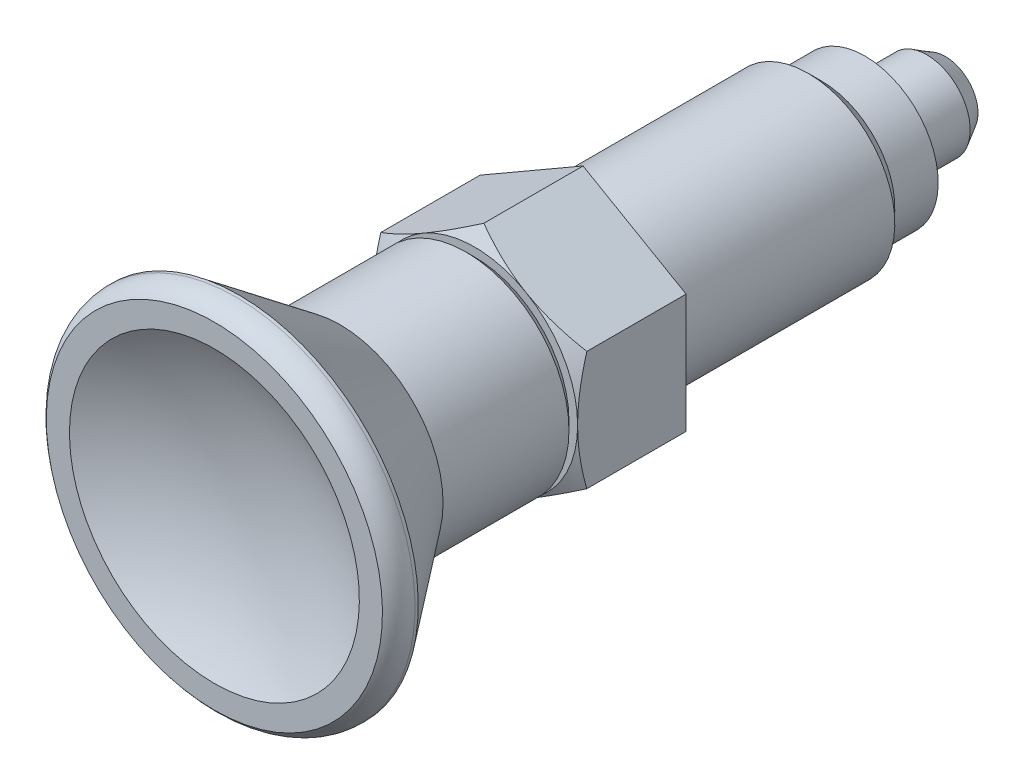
ISO-10303-21;
HEADER;
FILE_DESCRIPTION(('STEP AP214'),'2;1');
FILE_NAME('part.step','',(''),(''),'','','');
FILE_SCHEMA(('AUTOMOTIVE_DESIGN { 1 0 10303 214 1 1 1 1 }'));
ENDSEC;
DATA;
#1=APPLICATION_CONTEXT('core data for automotive mechanical design processes');
#2=APPLICATION_PROTOCOL_DEFINITION('international standard','automotive_design',2000,#1);
#3=PRODUCT_CONTEXT('',#1,'mechanical');
#4=PRODUCT('Part','Part','',(#3));
#5=PRODUCT_RELATED_PRODUCT_CATEGORY('part','',(#4));
#6=PRODUCT_DEFINITION_FORMATION('','',#4);
#7=PRODUCT_DEFINITION_CONTEXT('part definition',#1,'design');
#8=PRODUCT_DEFINITION('design','',#6,#7);
#9=PRODUCT_DEFINITION_SHAPE('','',#8);
#10=(LENGTH_UNIT() NAMED_UNIT(*) SI_UNIT(.MILLI.,.METRE.));
#11=(NAMED_UNIT(*) PLANE_ANGLE_UNIT() SI_UNIT($,.RADIAN.));
#12=(NAMED_UNIT(*) SI_UNIT($,.STERADIAN.) SOLID_ANGLE_UNIT());
#13=UNCERTAINTY_MEASURE_WITH_UNIT(LENGTH_MEASURE(1.E-05),#10,'distance_accuracy_value','');
#14=(GEOMETRIC_REPRESENTATION_CONTEXT(3) GLOBAL_UNCERTAINTY_ASSIGNED_CONTEXT((#13)) GLOBAL_UNIT_ASSIGNED_CONTEXT((#10,
#11,#12)) REPRESENTATION_CONTEXT('',''));
#15=CARTESIAN_POINT('',(0.,0.,0.));
#16=DIRECTION('',(0.,0.,1.));
#17=DIRECTION('',(1.,0.,0.));
#18=AXIS2_PLACEMENT_3D('',#15,#16,#17);
#19=CARTESIAN_POINT('',(0.,0.,56.3));
#20=DIRECTION('',(1.,0.,0.));
#21=DIRECTION('',(0.,-1.,0.));
#22=AXIS2_PLACEMENT_3D('',#19,#20,#21);
#23=SPHERICAL_SURFACE('',#22,26.);
#24=CARTESIAN_POINT('',(0.,-13.3682459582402,34.));
#25=CARTESIAN_POINT('',(0.375585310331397,-13.3682486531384,34.));
#26=CARTESIAN_POINT('',(0.751126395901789,-13.3524111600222,34.));
#27=CARTESIAN_POINT('',(1.49966463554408,-13.2891717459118,34.));
#28=CARTESIAN_POINT('',(1.87266109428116,-13.2417615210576,34.));
#29=CARTESIAN_POINT('',(2.61372997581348,-13.1156339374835,34.));
#30=CARTESIAN_POINT('',(2.98179666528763,-13.0368829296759,34.));
#31=CARTESIAN_POINT('',(3.70998226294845,-12.848636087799,34.));
#32=CARTESIAN_POINT('',(4.07010119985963,-12.7391403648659,34.));
#33=CARTESIAN_POINT('',(4.77965529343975,-12.4902434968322,34.));
#34=CARTESIAN_POINT('',(5.12909553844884,-12.3508568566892,34.));
#35=CARTESIAN_POINT('',(5.81499557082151,-12.0431356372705,34.));
#36=CARTESIAN_POINT('',(6.15145515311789,-11.8748006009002,34.));
#37=CARTESIAN_POINT('',(6.80891126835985,-11.5104276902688,34.));
#38=CARTESIAN_POINT('',(7.12991172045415,-11.314396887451,34.));
#39=CARTESIAN_POINT('',(7.75425858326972,-10.8959942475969,34.));
#40=CARTESIAN_POINT('',(8.05760506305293,-10.673622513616,34.));
#41=CARTESIAN_POINT('',(8.64452045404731,-10.2040929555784,34.));
#42=CARTESIAN_POINT('',(8.92808725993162,-9.95693249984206,34.));
#43=CARTESIAN_POINT('',(9.47339223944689,-9.43960204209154,34.));
#44=CARTESIAN_POINT('',(9.7351303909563,-9.16943201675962,34.));
#45=CARTESIAN_POINT('',(10.2349267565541,-8.60799236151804,34.));
#46=CARTESIAN_POINT('',(10.472984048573,-8.31672191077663,34.));
#47=CARTESIAN_POINT('',(10.9237145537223,-7.7151616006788,34.));
#48=CARTESIAN_POINT('',(11.1363877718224,-7.40487174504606,34.));
#49=CARTESIAN_POINT('',(11.5348344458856,-6.76748455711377,34.));
#50=CARTESIAN_POINT('',(11.7206084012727,-6.44038753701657,34.));
#51=CARTESIAN_POINT('',(12.063940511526,-5.77170618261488,34.));
#52=CARTESIAN_POINT('',(12.2214986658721,-5.43012184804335,34.));
#53=CARTESIAN_POINT('',(12.5072787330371,-4.73489504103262,34.));
#54=CARTESIAN_POINT('',(12.6355007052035,-4.38125259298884,34.));
#55=CARTESIAN_POINT('',(12.8616972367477,-3.66442308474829,34.));
#56=CARTESIAN_POINT('',(12.9596717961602,-3.30123602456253,34.));
#57=CARTESIAN_POINT('',(13.1246771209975,-2.56789862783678,34.));
#58=CARTESIAN_POINT('',(13.1917078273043,-2.19774827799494,34.));
#59=CARTESIAN_POINT('',(13.2943486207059,-1.45311652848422,34.));
#60=CARTESIAN_POINT('',(13.3299587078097,-1.07863512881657,34.));
#61=CARTESIAN_POINT('',(13.3695050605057,-0.328004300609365,34.));
#62=CARTESIAN_POINT('',(13.373441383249,0.0481451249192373,34.));
#63=CARTESIAN_POINT('',(13.3496123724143,0.799438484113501,34.));
#64=CARTESIAN_POINT('',(13.3218470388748,1.17458241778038,34.));
#65=CARTESIAN_POINT('',(13.2348120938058,1.92119788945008,34.));
#66=CARTESIAN_POINT('',(13.1755424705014,2.29266942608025,34.));
#67=CARTESIAN_POINT('',(13.0259203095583,3.02929902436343,34.));
#68=CARTESIAN_POINT('',(12.9355677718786,3.39445708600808,34.));
#69=CARTESIAN_POINT('',(12.7244220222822,4.11586406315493,34.));
#70=CARTESIAN_POINT('',(12.6036287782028,4.47211296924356,34.));
#71=CARTESIAN_POINT('',(12.3324604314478,5.17316851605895,34.));
#72=CARTESIAN_POINT('',(12.182085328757,5.51797515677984,34.));
#73=CARTESIAN_POINT('',(11.8528223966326,6.19369469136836,34.));
#74=CARTESIAN_POINT('',(11.6739345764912,6.5246075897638,34.));
#75=CARTESIAN_POINT('',(11.2889179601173,7.17018716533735,34.));
#76=CARTESIAN_POINT('',(11.0827891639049,7.48485384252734,34.));
#77=CARTESIAN_POINT('',(10.644756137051,8.09570375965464,34.));
#78=CARTESIAN_POINT('',(10.4128519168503,8.39188700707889,34.));
#79=CARTESIAN_POINT('',(9.92491667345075,8.96366451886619,34.));
#80=CARTESIAN_POINT('',(9.66888565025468,9.23925878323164,34.));
#81=CARTESIAN_POINT('',(9.13451699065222,9.76789905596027,34.));
#82=CARTESIAN_POINT('',(8.85617935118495,10.0209450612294,34.));
#83=CARTESIAN_POINT('',(8.2791763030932,10.5026897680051,34.));
#84=CARTESIAN_POINT('',(7.98051089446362,10.7313884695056,34.));
#85=CARTESIAN_POINT('',(7.36497559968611,11.1628126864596,34.));
#86=CARTESIAN_POINT('',(7.04810571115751,11.3655381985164,34.));
#87=CARTESIAN_POINT('',(6.39841424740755,11.7435747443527,34.));
#88=CARTESIAN_POINT('',(6.06559267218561,11.9188857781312,34.));
#89=CARTESIAN_POINT('',(5.38636401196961,12.2408470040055,34.));
#90=CARTESIAN_POINT('',(5.03995692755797,12.3874971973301,34.));
#91=CARTESIAN_POINT('',(4.33601998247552,12.6510941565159,34.));
#92=CARTESIAN_POINT('',(3.9784901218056,12.7680409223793,34.));
#93=CARTESIAN_POINT('',(3.25484946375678,12.9713996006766,34.));
#94=CARTESIAN_POINT('',(2.8887386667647,13.0578115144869,34.));
#95=CARTESIAN_POINT('',(2.15053894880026,13.1994861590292,34.));
#96=CARTESIAN_POINT('',(1.77845002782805,13.2547488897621,34.));
#97=CARTESIAN_POINT('',(1.03093939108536,13.3337322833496,34.));
#98=CARTESIAN_POINT('',(0.655517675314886,13.3574529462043,34.));
#99=CARTESIAN_POINT('',(-0.09598952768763,13.3731835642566,34.));
#100=CARTESIAN_POINT('',(-0.472075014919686,13.3651935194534,34.));
#101=CARTESIAN_POINT('',(-1.22223603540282,13.3175595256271,34.));
#102=CARTESIAN_POINT('',(-1.5963115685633,13.277915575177,34.));
#103=CARTESIAN_POINT('',(-2.33979321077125,13.1672556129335,34.));
#104=CARTESIAN_POINT('',(-2.70919931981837,13.0962396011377,34.));
#105=CARTESIAN_POINT('',(-3.44071587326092,12.9233403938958,34.));
#106=CARTESIAN_POINT('',(-3.80282631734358,12.8214571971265,34.));
#107=CARTESIAN_POINT('',(-4.51717713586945,12.5875479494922,34.));
#108=CARTESIAN_POINT('',(-4.86941751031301,12.4555218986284,34.));
#109=CARTESIAN_POINT('',(-5.56152392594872,12.1622655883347,34.));
#110=CARTESIAN_POINT('',(-5.90138996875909,12.001035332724,34.));
#111=CARTESIAN_POINT('',(-6.56633152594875,11.6505168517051,34.));
#112=CARTESIAN_POINT('',(-6.89140704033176,11.461228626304,34.));
#113=CARTESIAN_POINT('',(-7.52445640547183,11.0559399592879,34.));
#114=CARTESIAN_POINT('',(-7.83243025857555,10.8399395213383,34.));
#115=CARTESIAN_POINT('',(-8.42908684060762,10.3827620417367,34.));
#116=CARTESIAN_POINT('',(-8.71776956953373,10.1415850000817,34.));
#117=CARTESIAN_POINT('',(-9.27379165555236,9.63576883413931,34.));
#118=CARTESIAN_POINT('',(-9.54113100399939,9.37112970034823,34.));
#119=CARTESIAN_POINT('',(-10.0525655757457,8.82027085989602,34.));
#120=CARTESIAN_POINT('',(-10.296660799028,8.53405115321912,34.));
#121=CARTESIAN_POINT('',(-10.7598718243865,7.9420659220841,34.));
#122=CARTESIAN_POINT('',(-10.9789876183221,7.63630039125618,34.));
#123=CARTESIAN_POINT('',(-11.3906819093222,7.0073974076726,34.));
#124=CARTESIAN_POINT('',(-11.5832604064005,6.68425995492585,34.));
#125=CARTESIAN_POINT('',(-11.9405107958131,6.02291079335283,34.));
#126=CARTESIAN_POINT('',(-12.1051827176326,5.68469910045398,34.));
#127=CARTESIAN_POINT('',(-12.405449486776,4.9956056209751,34.));
#128=CARTESIAN_POINT('',(-12.5410443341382,4.64472383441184,34.));
#129=CARTESIAN_POINT('',(-12.782192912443,3.93278485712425,34.));
#130=CARTESIAN_POINT('',(-12.8877466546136,3.5717276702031,34.));
#131=CARTESIAN_POINT('',(-13.0680626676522,2.84200466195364,34.));
#132=CARTESIAN_POINT('',(-13.1428249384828,2.4733388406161,34.));
#133=CARTESIAN_POINT('',(-13.2610266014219,1.73101888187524,34.));
#134=CARTESIAN_POINT('',(-13.3044659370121,1.35736473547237,34.));
#135=CARTESIAN_POINT('',(-13.3597126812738,0.607725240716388,34.));
#136=CARTESIAN_POINT('',(-13.3715200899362,0.231739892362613,34.));
#137=CARTESIAN_POINT('',(-13.3634190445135,-0.519888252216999,34.));
#138=CARTESIAN_POINT('',(-13.3435106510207,-0.895531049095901,34.));
#139=CARTESIAN_POINT('',(-13.2721196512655,-1.64380422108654,34.));
#140=CARTESIAN_POINT('',(-13.2206370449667,-2.01643459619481,34.));
#141=CARTESIAN_POINT('',(-13.0864634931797,-2.75603450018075,34.));
#142=CARTESIAN_POINT('',(-13.0037724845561,-3.12300401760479,34.));
#143=CARTESIAN_POINT('',(-12.8077700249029,-3.84867248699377,34.));
#144=CARTESIAN_POINT('',(-12.6944585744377,-4.20737143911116,34.));
#145=CARTESIAN_POINT('',(-12.4380184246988,-4.91395521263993,34.));
#146=CARTESIAN_POINT('',(-12.2948891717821,-5.261839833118,34.));
#147=CARTESIAN_POINT('',(-11.9798322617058,-5.94431469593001,34.));
#148=CARTESIAN_POINT('',(-11.8079045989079,-6.27890493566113,34.));
#149=CARTESIAN_POINT('',(-11.4364804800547,-6.93239940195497,34.));
#150=CARTESIAN_POINT('',(-11.2369850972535,-7.25130423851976,34.));
#151=CARTESIAN_POINT('',(-10.8118388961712,-7.87117441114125,34.));
#152=CARTESIAN_POINT('',(-10.5861881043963,-8.17213976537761,34.));
#153=CARTESIAN_POINT('',(-10.110360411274,-8.75396077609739,34.));
#154=CARTESIAN_POINT('',(-9.86018611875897,-9.03481856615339,34.));
#155=CARTESIAN_POINT('',(-9.33706848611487,-9.57446448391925,34.));
#156=CARTESIAN_POINT('',(-9.06412505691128,-9.83325252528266,34.));
#157=CARTESIAN_POINT('',(-8.49733759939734,-10.3269813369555,34.));
#158=CARTESIAN_POINT('',(-8.20348826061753,-10.5619160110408,34.));
#159=CARTESIAN_POINT('',(-7.59704532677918,-11.0061886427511,34.));
#160=CARTESIAN_POINT('',(-7.28445202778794,-11.2155270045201,34.));
#161=CARTESIAN_POINT('',(-6.64258363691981,-11.6072177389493,34.));
#162=CARTESIAN_POINT('',(-6.31330053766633,-11.7895569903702,34.));
#163=CARTESIAN_POINT('',(-5.64053678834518,-12.1258308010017,34.));
#164=CARTESIAN_POINT('',(-5.2970560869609,-12.2797652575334,34.));
#165=CARTESIAN_POINT('',(-4.59871120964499,-12.5579840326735,34.));
#166=CARTESIAN_POINT('',(-4.24385967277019,-12.682300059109,34.));
#167=CARTESIAN_POINT('',(-3.52506734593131,-12.9005804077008,34.));
#168=CARTESIAN_POINT('',(-3.16112897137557,-12.99455270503,34.));
#169=CARTESIAN_POINT('',(-2.33514245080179,-13.1710678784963,34.));
#170=CARTESIAN_POINT('',(-1.87121744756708,-13.2449469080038,34.));
#171=CARTESIAN_POINT('',(-0.938171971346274,-13.3435342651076,34.));
#172=CARTESIAN_POINT('',(-0.46905149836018,-13.3682425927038,34.));
#173=CARTESIAN_POINT('',(0.,-13.3682459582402,34.));
#174=B_SPLINE_CURVE_WITH_KNOTS('',3,(#24,#25,#26,#27,#28,#29,#30,#31,#32,#33,#34,#35,#36,#37,
#38,#39,#40,#41,#42,#43,#44,#45,#46,#47,#48,#49,#50,#51,#52,#53,#54,#55,#56,#57,#58,#59,#60,#61,
#62,#63,#64,#65,#66,#67,#68,#69,#70,#71,#72,#73,#74,#75,#76,#77,#78,#79,#80,#81,#82,#83,#84,#85,
#86,#87,#88,#89,#90,#91,#92,#93,#94,#95,#96,#97,#98,#99,#100,#101,#102,#103,#104,#105,#106,#107,
#108,#109,#110,#111,#112,#113,#114,#115,#116,#117,#118,#119,#120,#121,#122,#123,#124,#125,#126,
#127,#128,#129,#130,#131,#132,#133,#134,#135,#136,#137,#138,#139,#140,#141,#142,#143,#144,#145,
#146,#147,#148,#149,#150,#151,#152,#153,#154,#155,#156,#157,#158,#159,#160,#161,#162,#163,#164,
#165,#166,#167,#168,#169,#170,#171,#172,#173),.UNSPECIFIED.,.T.,.F.,(4,2,2,2,2,2,2,2,2,2,2,2,2,
2,2,2,2,2,2,2,2,2,2,2,2,2,2,2,2,2,2,2,2,2,2,2,2,2,2,2,2,2,2,2,2,2,2,2,2,2,2,2,2,2,2,2,2,2,2,2,2,
2,2,2,2,2,2,2,2,2,2,2,2,2,4),(0.,1.12634621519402,2.25298878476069,3.38084425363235,
4.50869564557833,5.63600096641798,6.76332408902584,7.89035989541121,9.01739129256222,
10.1445424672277,11.2716947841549,12.3988909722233,13.5260869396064,14.6532619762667,
15.7804370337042,16.907609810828,18.0347825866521,19.1619575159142,20.2891324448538,
21.4163053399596,22.5434782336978,23.6706515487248,24.7978248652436,25.9249993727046,
27.0521738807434,28.1793480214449,29.3065221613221,30.4336958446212,31.5608695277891,
32.6880433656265,33.8152172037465,34.9423911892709,36.0695651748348,37.1967391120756,
38.3239130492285,39.4510869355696,40.5782608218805,41.7054347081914,42.8326085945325,
43.9597825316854,45.0869564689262,46.2141304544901,47.3413044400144,48.4684782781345,
49.5956521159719,50.7228257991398,51.8499994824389,52.9771736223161,54.1043477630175,
55.2315222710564,56.3586967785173,57.4858700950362,58.6130434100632,59.7402163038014,
60.8673891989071,61.9945641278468,63.1217390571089,64.248911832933,65.3760846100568,
66.5032596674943,67.6304347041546,68.7576306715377,69.8848268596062,71.0119791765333,
72.1391303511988,73.2661617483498,74.3931975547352,75.520520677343,76.6478259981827,
77.7756773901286,78.9035328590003,80.030175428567,81.156521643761,82.5631644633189,
83.9698072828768),.UNSPECIFIED.);
#175=CARTESIAN_POINT('',(0.,-13.3682459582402,34.));
#176=VERTEX_POINT('',#175);
#177=EDGE_CURVE('E19',#176,#176,#174,.T.);
#178=ORIENTED_EDGE('',*,*,#177,.T.);
#179=EDGE_LOOP('',(#178));
#180=FACE_BOUND('',#179,.T.);
#181=ADVANCED_FACE('F14',(#180),#23,.F.);
#182=CARTESIAN_POINT('',(-13.36824595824,0.,34.));
#183=DIRECTION('',(0.,0.,-1.));
#184=DIRECTION('',(0.,-1.,0.));
#185=AXIS2_PLACEMENT_3D('',#182,#183,#184);
#186=PLANE('',#185);
#187=ORIENTED_EDGE('',*,*,#177,.F.);
#188=EDGE_LOOP('',(#187));
#189=FACE_BOUND('',#188,.T.);
#190=CARTESIAN_POINT('',(0.,0.,34.));
#191=DIRECTION('',(0.,0.,-1.));
#192=DIRECTION('',(0.,-1.,0.));
#193=AXIS2_PLACEMENT_3D('',#190,#191,#192);
#194=CIRCLE('',#193,15.5);
#195=CARTESIAN_POINT('',(0.,-15.5,34.));
#196=VERTEX_POINT('',#195);
#197=EDGE_CURVE('E422',#196,#196,#194,.T.);
#198=ORIENTED_EDGE('',*,*,#197,.F.);
#199=EDGE_LOOP('',(#198));
#200=FACE_BOUND('',#199,.T.);
#201=ADVANCED_FACE('F357',(#189,#200),#186,.F.);
#202=CARTESIAN_POINT('',(0.,0.,-26.));
#203=DIRECTION('',(1.,0.,0.));
#204=DIRECTION('',(0.,-1.,0.));
#205=AXIS2_PLACEMENT_3D('',#202,#203,#204);
#206=SPHERICAL_SURFACE('',#205,8.);
#207=CARTESIAN_POINT('',(0.,0.,-33.4113534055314));
#208=DIRECTION('',(0.,0.,1.));
#209=DIRECTION('',(0.,1.,0.));
#210=AXIS2_PLACEMENT_3D('',#207,#208,#209);
#211=CIRCLE('',#210,3.01194965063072);
#212=CARTESIAN_POINT('',(0.,3.01194965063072,-33.4113534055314));
#213=VERTEX_POINT('',#212);
#214=EDGE_CURVE('E341',#213,#213,#211,.T.);
#215=ORIENTED_EDGE('',*,*,#214,.F.);
#216=EDGE_LOOP('',(#215));
#217=FACE_BOUND('',#216,.T.);
#218=ADVANCED_FACE('F353',(#217),#206,.T.);
#219=CARTESIAN_POINT('',(0.,0.,32.));
#220=DIRECTION('',(0.,0.,-1.));
#221=DIRECTION('',(0.,-1.,0.));
#222=AXIS2_PLACEMENT_3D('',#219,#220,#221);
#223=TOROIDAL_SURFACE('',#222,14.,2.5);
#224=CARTESIAN_POINT('',(0.,0.,32.));
#225=DIRECTION('',(0.,0.,1.));
#226=DIRECTION('',(0.,1.,0.));
#227=AXIS2_PLACEMENT_3D('',#224,#225,#226);
#228=CIRCLE('',#227,16.5);
#229=CARTESIAN_POINT('',(0.,16.5,32.));
#230=VERTEX_POINT('',#229);
#231=EDGE_CURVE('E336',#230,#230,#228,.F.);
#232=ORIENTED_EDGE('',*,*,#231,.F.);
#233=EDGE_LOOP('',(#232));
#234=FACE_BOUND('',#233,.T.);
#235=ORIENTED_EDGE('',*,*,#197,.T.);
#236=EDGE_LOOP('',(#235));
#237=FACE_BOUND('',#236,.T.);
#238=ADVANCED_FACE('F348',(#234,#237),#223,.T.);
#239=CARTESIAN_POINT('',(0.,0.,-31.700000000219));
#240=DIRECTION('',(0.,0.,1.));
#241=DIRECTION('',(0.,1.,0.));
#242=AXIS2_PLACEMENT_3D('',#239,#240,#241);
#243=CONICAL_SURFACE('',#242,3.99999999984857,0.523598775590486);
#244=CARTESIAN_POINT('',(0.,0.,-31.7));
#245=DIRECTION('',(0.,0.,1.));
#246=DIRECTION('',(0.,1.,0.));
#247=AXIS2_PLACEMENT_3D('',#244,#245,#246);
#248=CIRCLE('',#247,4.);
#249=CARTESIAN_POINT('',(0.,4.,-31.7));
#250=VERTEX_POINT('',#249);
#251=EDGE_CURVE('E331',#250,#250,#248,.T.);
#252=ORIENTED_EDGE('',*,*,#251,.F.);
#253=EDGE_LOOP('',(#252));
#254=FACE_BOUND('',#253,.T.);
#255=ORIENTED_EDGE('',*,*,#214,.T.);
#256=EDGE_LOOP('',(#255));
#257=FACE_BOUND('',#256,.T.);
#258=ADVANCED_FACE('F352',(#254,#257),#243,.T.);
#259=CARTESIAN_POINT('',(0.,0.,-34.));
#260=DIRECTION('',(0.,0.,1.));
#261=DIRECTION('',(0.,1.,0.));
#262=AXIS2_PLACEMENT_3D('',#259,#260,#261);
#263=CYLINDRICAL_SURFACE('',#262,16.5);
#264=ORIENTED_EDGE('',*,*,#231,.T.);
#265=EDGE_LOOP('',(#264));
#266=FACE_BOUND('',#265,.T.);
#267=CARTESIAN_POINT('',(0.,0.,31.7));
#268=DIRECTION('',(0.,0.,1.));
#269=DIRECTION('',(0.,1.,0.));
#270=AXIS2_PLACEMENT_3D('',#267,#268,#269);
#271=CIRCLE('',#270,16.5);
#272=CARTESIAN_POINT('',(0.,16.5,31.7));
#273=VERTEX_POINT('',#272);
#274=EDGE_CURVE('E318',#273,#273,#271,.F.);
#275=ORIENTED_EDGE('',*,*,#274,.F.);
#276=EDGE_LOOP('',(#275));
#277=FACE_BOUND('',#276,.T.);
#278=ADVANCED_FACE('F430',(#266,#277),#263,.T.);
#279=CARTESIAN_POINT('',(0.,0.,-34.));
#280=DIRECTION('',(0.,0.,1.));
#281=DIRECTION('',(0.,1.,0.));
#282=AXIS2_PLACEMENT_3D('',#279,#280,#281);
#283=CYLINDRICAL_SURFACE('',#282,4.);
#284=CARTESIAN_POINT('',(0.,0.,-26.3732050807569));
#285=DIRECTION('',(0.,0.,-1.));
#286=DIRECTION('',(0.,-1.,0.));
#287=AXIS2_PLACEMENT_3D('',#284,#285,#286);
#288=CIRCLE('',#287,4.);
#289=CARTESIAN_POINT('',(0.,-4.,-26.3732050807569));
#290=VERTEX_POINT('',#289);
#291=EDGE_CURVE('E315',#290,#290,#288,.T.);
#292=ORIENTED_EDGE('',*,*,#291,.T.);
#293=EDGE_LOOP('',(#292));
#294=FACE_BOUND('',#293,.T.);
#295=ORIENTED_EDGE('',*,*,#251,.T.);
#296=EDGE_LOOP('',(#295));
#297=FACE_BOUND('',#296,.T.);
#298=ADVANCED_FACE('F435',(#294,#297),#283,.T.);
#299=CARTESIAN_POINT('',(0.,0.,31.7));
#300=DIRECTION('',(0.,0.,1.));
#301=DIRECTION('',(1.,0.,0.));
#302=AXIS2_PLACEMENT_3D('',#299,#300,#301);
#303=CONICAL_SURFACE('',#302,16.5,0.645771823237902);
#304=ORIENTED_EDGE('',*,*,#274,.T.);
#305=EDGE_LOOP('',(#304));
#306=FACE_BOUND('',#305,.T.);
#307=CARTESIAN_POINT('',(0.,0.,22.4106862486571));
#308=DIRECTION('',(0.,0.,1.));
#309=DIRECTION('',(0.,1.,0.));
#310=AXIS2_PLACEMENT_3D('',#307,#308,#309);
#311=CIRCLE('',#310,9.5);
#312=CARTESIAN_POINT('',(0.,9.5,22.4106862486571));
#313=VERTEX_POINT('',#312);
#314=EDGE_CURVE('E284',#313,#313,#311,.F.);
#315=ORIENTED_EDGE('',*,*,#314,.F.);
#316=EDGE_LOOP('',(#315));
#317=FACE_BOUND('',#316,.T.);
#318=ADVANCED_FACE('F308',(#306,#317),#303,.T.);
#319=CARTESIAN_POINT('',(0.,0.,-26.2));
#320=DIRECTION('',(0.,0.,-1.));
#321=DIRECTION('',(0.,-1.,0.));
#322=AXIS2_PLACEMENT_3D('',#319,#320,#321);
#323=TOROIDAL_SURFACE('',#322,4.1,0.2);
#324=CARTESIAN_POINT('',(0.,0.,-26.));
#325=DIRECTION('',(0.,0.,-1.));
#326=DIRECTION('',(0.,-1.,0.));
#327=AXIS2_PLACEMENT_3D('',#324,#325,#326);
#328=CIRCLE('',#327,4.1);
#329=CARTESIAN_POINT('',(0.,-4.1,-26.));
#330=VERTEX_POINT('',#329);
#331=EDGE_CURVE('E273',#330,#330,#328,.T.);
#332=ORIENTED_EDGE('',*,*,#331,.T.);
#333=EDGE_LOOP('',(#332));
#334=FACE_BOUND('',#333,.T.);
#335=ORIENTED_EDGE('',*,*,#291,.F.);
#336=EDGE_LOOP('',(#335));
#337=FACE_BOUND('',#336,.T.);
#338=ADVANCED_FACE('F302',(#334,#337),#323,.F.);
#339=CARTESIAN_POINT('',(0.,0.,-34.));
#340=DIRECTION('',(0.,0.,1.));
#341=DIRECTION('',(0.,1.,0.));
#342=AXIS2_PLACEMENT_3D('',#339,#340,#341);
#343=CYLINDRICAL_SURFACE('',#342,9.5);
#344=ORIENTED_EDGE('',*,*,#314,.T.);
#345=EDGE_LOOP('',(#344));
#346=FACE_BOUND('',#345,.T.);
#347=CARTESIAN_POINT('',(0.,0.,10.8));
#348=DIRECTION('',(0.,0.,1.));
#349=DIRECTION('',(0.,1.,0.));
#350=AXIS2_PLACEMENT_3D('',#347,#348,#349);
#351=CIRCLE('',#350,9.5);
#352=CARTESIAN_POINT('',(0.,9.5,10.8));
#353=VERTEX_POINT('',#352);
#354=EDGE_CURVE('E269',#353,#353,#351,.F.);
#355=ORIENTED_EDGE('',*,*,#354,.F.);
#356=EDGE_LOOP('',(#355));
#357=FACE_BOUND('',#356,.T.);
#358=ADVANCED_FACE('F297',(#346,#357),#343,.T.);
#359=CARTESIAN_POINT('',(-5.2,0.,-26.));
#360=DIRECTION('',(0.,0.,1.));
#361=DIRECTION('',(0.,1.,0.));
#362=AXIS2_PLACEMENT_3D('',#359,#360,#361);
#363=PLANE('',#362);
#364=CARTESIAN_POINT('',(0.,0.,-26.0000000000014));
#365=DIRECTION('',(0.,0.,1.));
#366=DIRECTION('',(0.,1.,0.));
#367=AXIS2_PLACEMENT_3D('',#364,#365,#366);
#368=CIRCLE('',#367,5.19999999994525);
#369=CARTESIAN_POINT('',(0.,5.19999999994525,-26.0000000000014));
#370=VERTEX_POINT('',#369);
#371=EDGE_CURVE('E272',#370,#370,#368,.T.);
#372=ORIENTED_EDGE('',*,*,#371,.F.);
#373=EDGE_LOOP('',(#372));
#374=FACE_BOUND('',#373,.T.);
#375=ORIENTED_EDGE('',*,*,#331,.F.);
#376=EDGE_LOOP('',(#375));
#377=FACE_BOUND('',#376,.T.);
#378=ADVANCED_FACE('F286',(#374,#377),#363,.F.);
#379=CARTESIAN_POINT('',(0.,0.,10.8));
#380=DIRECTION('',(0.,0.,1.));
#381=DIRECTION('',(1.,0.,0.));
#382=AXIS2_PLACEMENT_3D('',#379,#380,#381);
#383=CONICAL_SURFACE('',#382,9.5,0.785398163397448);
#384=ORIENTED_EDGE('',*,*,#354,.T.);
#385=EDGE_LOOP('',(#384));
#386=FACE_BOUND('',#385,.T.);
#387=CARTESIAN_POINT('',(0.,0.,10.));
#388=DIRECTION('',(0.,0.,1.));
#389=DIRECTION('',(1.,0.,0.));
#390=AXIS2_PLACEMENT_3D('',#387,#388,#389);
#391=CIRCLE('',#390,8.7);
#392=CARTESIAN_POINT('',(8.7,0.,10.));
#393=VERTEX_POINT('',#392);
#394=EDGE_CURVE('E266',#393,#393,#391,.F.);
#395=ORIENTED_EDGE('',*,*,#394,.F.);
#396=EDGE_LOOP('',(#395));
#397=FACE_BOUND('',#396,.T.);
#398=ADVANCED_FACE('F296',(#386,#397),#383,.T.);
#399=CARTESIAN_POINT('',(0.,0.,-25.7000000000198));
#400=DIRECTION('',(0.,0.,1.));
#401=DIRECTION('',(0.,1.,0.));
#402=AXIS2_PLACEMENT_3D('',#399,#400,#401);
#403=CONICAL_SURFACE('',#402,5.49999999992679,0.785398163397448);
#404=CARTESIAN_POINT('',(0.,0.,-25.7));
#405=DIRECTION('',(0.,0.,1.));
#406=DIRECTION('',(0.,1.,0.));
#407=AXIS2_PLACEMENT_3D('',#404,#405,#406);
#408=CIRCLE('',#407,5.5);
#409=CARTESIAN_POINT('',(0.,5.5,-25.7));
#410=VERTEX_POINT('',#409);
#411=EDGE_CURVE('E99',#410,#410,#408,.F.);
#412=ORIENTED_EDGE('',*,*,#411,.T.);
#413=EDGE_LOOP('',(#412));
#414=FACE_BOUND('',#413,.T.);
#415=ORIENTED_EDGE('',*,*,#371,.T.);
#416=EDGE_LOOP('',(#415));
#417=FACE_BOUND('',#416,.T.);
#418=ADVANCED_FACE('F458',(#414,#417),#403,.T.);
#419=CARTESIAN_POINT('',(-9.5,0.,10.));
#420=DIRECTION('',(0.,0.,1.));
#421=DIRECTION('',(0.,1.,0.));
#422=AXIS2_PLACEMENT_3D('',#419,#420,#421);
#423=PLANE('',#422);
#424=CARTESIAN_POINT('',(0.,0.,10.));
#425=DIRECTION('',(0.,0.,-1.));
#426=DIRECTION('',(0.,-1.,0.));
#427=AXIS2_PLACEMENT_3D('',#424,#425,#426);
#428=CIRCLE('',#427,9.5);
#429=CARTESIAN_POINT('',(4.75,8.22724133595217,10.));
#430=VERTEX_POINT('',#429);
#431=CARTESIAN_POINT('',(9.5,0.,10.));
#432=VERTEX_POINT('',#431);
#433=EDGE_CURVE('E394',#430,#432,#428,.T.);
#434=ORIENTED_EDGE('',*,*,#433,.F.);
#435=CARTESIAN_POINT('',(0.,0.,10.));
#436=DIRECTION('',(0.,0.,-1.));
#437=DIRECTION('',(0.,-1.,0.));
#438=AXIS2_PLACEMENT_3D('',#435,#436,#437);
#439=CIRCLE('',#438,9.5);
#440=CARTESIAN_POINT('',(-4.75,8.22724133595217,10.));
#441=VERTEX_POINT('',#440);
#442=EDGE_CURVE('E397',#441,#430,#439,.T.);
#443=ORIENTED_EDGE('',*,*,#442,.F.);
#444=CARTESIAN_POINT('',(0.,0.,10.));
#445=DIRECTION('',(0.,0.,-1.));
#446=DIRECTION('',(0.,-1.,0.));
#447=AXIS2_PLACEMENT_3D('',#444,#445,#446);
#448=CIRCLE('',#447,9.5);
#449=CARTESIAN_POINT('',(-9.5,0.,10.));
#450=VERTEX_POINT('',#449);
#451=EDGE_CURVE('E94',#450,#441,#448,.T.);
#452=ORIENTED_EDGE('',*,*,#451,.F.);
#453=CARTESIAN_POINT('',(0.,0.,10.));
#454=DIRECTION('',(0.,0.,-1.));
#455=DIRECTION('',(0.,-1.,0.));
#456=AXIS2_PLACEMENT_3D('',#453,#454,#455);
#457=CIRCLE('',#456,9.5);
#458=CARTESIAN_POINT('',(-4.75,-8.22724133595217,10.));
#459=VERTEX_POINT('',#458);
#460=EDGE_CURVE('E87',#459,#450,#457,.T.);
#461=ORIENTED_EDGE('',*,*,#460,.F.);
#462=CARTESIAN_POINT('',(0.,0.,10.));
#463=DIRECTION('',(0.,0.,-1.));
#464=DIRECTION('',(0.,-1.,0.));
#465=AXIS2_PLACEMENT_3D('',#462,#463,#464);
#466=CIRCLE('',#465,9.5);
#467=CARTESIAN_POINT('',(4.75,-8.22724133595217,10.));
#468=VERTEX_POINT('',#467);
#469=EDGE_CURVE('E91',#468,#459,#466,.T.);
#470=ORIENTED_EDGE('',*,*,#469,.F.);
#471=CARTESIAN_POINT('',(0.,0.,10.));
#472=DIRECTION('',(0.,0.,-1.));
#473=DIRECTION('',(0.,-1.,0.));
#474=AXIS2_PLACEMENT_3D('',#471,#472,#473);
#475=CIRCLE('',#474,9.5);
#476=EDGE_CURVE('E111',#432,#468,#475,.T.);
#477=ORIENTED_EDGE('',*,*,#476,.F.);
#478=EDGE_LOOP('',(#434,#443,#452,#461,#470,#477));
#479=FACE_BOUND('',#478,.T.);
#480=ORIENTED_EDGE('',*,*,#394,.T.);
#481=EDGE_LOOP('',(#480));
#482=FACE_BOUND('',#481,.T.);
#483=ADVANCED_FACE('F89',(#479,#482),#423,.T.);
#484=CARTESIAN_POINT('',(0.,0.,-26.));
#485=DIRECTION('',(0.,0.,1.));
#486=DIRECTION('',(0.,1.,0.));
#487=AXIS2_PLACEMENT_3D('',#484,#485,#486);
#488=CYLINDRICAL_SURFACE('',#487,5.5);
#489=ORIENTED_EDGE('',*,*,#411,.F.);
#490=EDGE_LOOP('',(#489));
#491=FACE_BOUND('',#490,.T.);
#492=CARTESIAN_POINT('',(0.,0.,-26.));
#493=DIRECTION('',(0.,0.,1.));
#494=DIRECTION('',(0.,1.,0.));
#495=AXIS2_PLACEMENT_3D('',#492,#493,#494);
#496=CIRCLE('',#495,5.5);
#497=CARTESIAN_POINT('',(0.,5.5,-26.));
#498=VERTEX_POINT('',#497);
#499=EDGE_CURVE('E110',#498,#498,#496,.T.);
#500=ORIENTED_EDGE('',*,*,#499,.F.);
#501=EDGE_LOOP('',(#500));
#502=FACE_BOUND('',#501,.T.);
#503=ADVANCED_FACE('F461',(#491,#502),#488,.F.);
#504=CARTESIAN_POINT('',(0.,0.,9.14640318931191));
#505=DIRECTION('',(0.,0.,-1.));
#506=DIRECTION('',(0.,-1.,0.));
#507=AXIS2_PLACEMENT_3D('',#504,#505,#506);
#508=CONICAL_SURFACE('',#507,10.9784730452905,1.0471975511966);
#509=CARTESIAN_POINT('',(-9.5,-5.48482755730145,9.1514942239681));
#510=CARTESIAN_POINT('',(-9.5,-5.03836493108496,9.28040921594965));
#511=CARTESIAN_POINT('',(-9.5,-4.5883268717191,9.39851785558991));
#512=CARTESIAN_POINT('',(-9.5,-3.68428371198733,9.60680031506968));
#513=CARTESIAN_POINT('',(-9.5,-3.23031014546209,9.69711226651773));
#514=CARTESIAN_POINT('',(-9.5,-2.54506538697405,9.80800000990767));
#515=CARTESIAN_POINT('',(-9.5,-2.31578485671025,9.84087935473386));
#516=CARTESIAN_POINT('',(-9.5,-1.8561261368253,9.89779418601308));
#517=CARTESIAN_POINT('',(-9.5,-1.62574797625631,9.92182990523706));
#518=CARTESIAN_POINT('',(-9.5,-1.16304185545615,9.96063517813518));
#519=CARTESIAN_POINT('',(-9.5,-0.930709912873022,9.97535760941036));
#520=CARTESIAN_POINT('',(-9.5,-0.465589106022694,9.99506039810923));
#521=CARTESIAN_POINT('',(-9.5,-0.232800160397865,10.000038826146));
#522=CARTESIAN_POINT('',(-9.5,0.,10.));
#523=B_SPLINE_CURVE_WITH_KNOTS('',3,(#509,#510,#511,#512,#513,#514,#515,#516,#517,#518,#519,
#520,#521,#522),.UNSPECIFIED.,.F.,.F.,(4,2,2,2,2,2,4),(0.,1.39466965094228,2.78229242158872,
3.47701423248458,4.17171775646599,4.86990873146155,5.56823793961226),.UNSPECIFIED.);
#524=CARTESIAN_POINT('',(-9.5,-5.48482755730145,9.1514942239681));
#525=VERTEX_POINT('',#524);
#526=EDGE_CURVE('E116',#525,#450,#523,.T.);
#527=ORIENTED_EDGE('',*,*,#526,.F.);
#528=CARTESIAN_POINT('',(-4.75,-8.22724133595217,10.));
#529=CARTESIAN_POINT('',(-4.95161085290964,-8.11084125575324,10.000038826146));
#530=CARTESIAN_POINT('',(-5.15321199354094,-7.99444678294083,9.99506039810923));
#531=CARTESIAN_POINT('',(-5.55601842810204,-7.76188637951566,9.97535760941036));
#532=CARTESIAN_POINT('',(-5.75722379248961,-7.6457204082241,9.96063517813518));
#533=CARTESIAN_POINT('',(-6.15793904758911,-7.41436734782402,9.92182990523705));
#534=CARTESIAN_POINT('',(-6.35745238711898,-7.29917826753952,9.89779418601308));
#535=CARTESIAN_POINT('',(-6.75552851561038,-7.06934890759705,9.84087935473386));
#536=CARTESIAN_POINT('',(-6.95409127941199,-6.95470864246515,9.80800000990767));
#537=CARTESIAN_POINT('',(-7.54753064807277,-6.61208626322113,9.69711226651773));
#538=CARTESIAN_POINT('',(-7.94068328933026,-6.38509947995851,9.60680031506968));
#539=CARTESIAN_POINT('',(-8.72360763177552,-5.93307790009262,9.39851785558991));
#540=CARTESIAN_POINT('',(-9.11335202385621,-5.70805887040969,9.28040921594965));
#541=CARTESIAN_POINT('',(-9.5,-5.48482755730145,9.1514942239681));
#542=B_SPLINE_CURVE_WITH_KNOTS('',3,(#528,#529,#530,#531,#532,#533,#534,#535,#536,#537,#538,
#539,#540,#541),.UNSPECIFIED.,.F.,.F.,(4,2,2,2,2,2,4),(0.,0.698329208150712,1.39652018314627,
2.09122370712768,2.78594551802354,4.17356828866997,5.56823793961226),.UNSPECIFIED.);
#543=EDGE_CURVE('E113',#459,#525,#542,.T.);
#544=ORIENTED_EDGE('',*,*,#543,.F.);
#545=ORIENTED_EDGE('',*,*,#460,.T.);
#546=EDGE_LOOP('',(#527,#544,#545));
#547=FACE_BOUND('',#546,.T.);
#548=ADVANCED_FACE('F114',(#547),#508,.T.);
#549=CARTESIAN_POINT('',(0.,0.,9.14640318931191));
#550=DIRECTION('',(0.,0.,-1.));
#551=DIRECTION('',(0.,-1.,0.));
#552=AXIS2_PLACEMENT_3D('',#549,#550,#551);
#553=CONICAL_SURFACE('',#552,10.9784730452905,1.0471975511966);
#554=CARTESIAN_POINT('',(-9.5,0.,10.));
#555=CARTESIAN_POINT('',(-9.5,0.232800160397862,10.000038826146));
#556=CARTESIAN_POINT('',(-9.5,0.465589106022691,9.99506039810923));
#557=CARTESIAN_POINT('',(-9.5,0.93070991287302,9.97535760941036));
#558=CARTESIAN_POINT('',(-9.5,1.16304185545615,9.96063517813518));
#559=CARTESIAN_POINT('',(-9.5,1.62574797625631,9.92182990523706));
#560=CARTESIAN_POINT('',(-9.5,1.8561261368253,9.89779418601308));
#561=CARTESIAN_POINT('',(-9.5,2.31578485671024,9.84087935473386));
#562=CARTESIAN_POINT('',(-9.5,2.54506538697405,9.80800000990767));
#563=CARTESIAN_POINT('',(-9.5,3.23031014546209,9.69711226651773));
#564=CARTESIAN_POINT('',(-9.5,3.68428371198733,9.60680031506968));
#565=CARTESIAN_POINT('',(-9.5,4.5883268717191,9.39851785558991));
#566=CARTESIAN_POINT('',(-9.5,5.03836493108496,9.28040921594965));
#567=CARTESIAN_POINT('',(-9.5,5.48482755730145,9.1514942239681));
#568=B_SPLINE_CURVE_WITH_KNOTS('',3,(#554,#555,#556,#557,#558,#559,#560,#561,#562,#563,#564,
#565,#566,#567),.UNSPECIFIED.,.F.,.F.,(4,2,2,2,2,2,4),(0.,0.698329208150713,1.39652018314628,
2.09122370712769,2.78594551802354,4.17356828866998,5.56823793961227),.UNSPECIFIED.);
#569=CARTESIAN_POINT('',(-9.5,5.48482755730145,9.1514942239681));
#570=VERTEX_POINT('',#569);
#571=EDGE_CURVE('E243',#450,#570,#568,.T.);
#572=ORIENTED_EDGE('',*,*,#571,.F.);
#573=ORIENTED_EDGE('',*,*,#451,.T.);
#574=CARTESIAN_POINT('',(-9.5,5.48482755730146,9.15149422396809));
#575=CARTESIAN_POINT('',(-9.11335202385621,5.7080588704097,9.28040921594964));
#576=CARTESIAN_POINT('',(-8.72360763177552,5.93307790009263,9.3985178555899));
#577=CARTESIAN_POINT('',(-7.94068328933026,6.38509947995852,9.60680031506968));
#578=CARTESIAN_POINT('',(-7.54753064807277,6.61208626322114,9.69711226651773));
#579=CARTESIAN_POINT('',(-6.95409127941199,6.95470864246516,9.80800000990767));
#580=CARTESIAN_POINT('',(-6.75552851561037,7.06934890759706,9.84087935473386));
#581=CARTESIAN_POINT('',(-6.35745238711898,7.29917826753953,9.89779418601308));
#582=CARTESIAN_POINT('',(-6.1579390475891,7.41436734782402,9.92182990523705));
#583=CARTESIAN_POINT('',(-5.75722379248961,7.64572040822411,9.96063517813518));
#584=CARTESIAN_POINT('',(-5.55601842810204,7.76188637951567,9.97535760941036));
#585=CARTESIAN_POINT('',(-5.15321199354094,7.99444678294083,9.99506039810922));
#586=CARTESIAN_POINT('',(-4.95161085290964,8.11084125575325,10.000038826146));
#587=CARTESIAN_POINT('',(-4.75,8.22724133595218,10.));
#588=B_SPLINE_CURVE_WITH_KNOTS('',3,(#574,#575,#576,#577,#578,#579,#580,#581,#582,#583,#584,
#585,#586,#587),.UNSPECIFIED.,.F.,.F.,(4,2,2,2,2,2,4),(0.,1.39466965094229,2.78229242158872,
3.47701423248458,4.17171775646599,4.86990873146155,5.56823793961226),.UNSPECIFIED.);
#589=EDGE_CURVE('E236',#570,#441,#588,.T.);
#590=ORIENTED_EDGE('',*,*,#589,.F.);
#591=EDGE_LOOP('',(#572,#573,#590));
#592=FACE_BOUND('',#591,.T.);
#593=ADVANCED_FACE('F213',(#592),#553,.T.);
#594=CARTESIAN_POINT('',(0.,0.,9.14640318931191));
#595=DIRECTION('',(0.,0.,-1.));
#596=DIRECTION('',(0.,-1.,0.));
#597=AXIS2_PLACEMENT_3D('',#594,#595,#596);
#598=CONICAL_SURFACE('',#597,10.9784730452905,1.0471975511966);
#599=CARTESIAN_POINT('',(-4.75,8.22724133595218,10.));
#600=CARTESIAN_POINT('',(-4.54838914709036,8.34364141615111,10.000038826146));
#601=CARTESIAN_POINT('',(-4.34678800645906,8.46003588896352,9.99506039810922));
#602=CARTESIAN_POINT('',(-3.94398157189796,8.69259629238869,9.97535760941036));
#603=CARTESIAN_POINT('',(-3.74277620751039,8.80876226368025,9.96063517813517));
#604=CARTESIAN_POINT('',(-3.3420609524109,9.04011532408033,9.92182990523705));
#605=CARTESIAN_POINT('',(-3.14254761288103,9.15530440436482,9.89779418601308));
#606=CARTESIAN_POINT('',(-2.74447148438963,9.3851337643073,9.84087935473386));
#607=CARTESIAN_POINT('',(-2.54590872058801,9.4997740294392,9.80800000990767));
#608=CARTESIAN_POINT('',(-1.95246935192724,9.84239640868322,9.69711226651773));
#609=CARTESIAN_POINT('',(-1.55931671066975,10.0693831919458,9.60680031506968));
#610=CARTESIAN_POINT('',(-0.776392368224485,10.5214047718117,9.3985178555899));
#611=CARTESIAN_POINT('',(-0.386647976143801,10.7464238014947,9.28040921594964));
#612=CARTESIAN_POINT('',(0.,10.9696551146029,9.1514942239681));
#613=B_SPLINE_CURVE_WITH_KNOTS('',3,(#599,#600,#601,#602,#603,#604,#605,#606,#607,#608,#609,
#610,#611,#612),.UNSPECIFIED.,.F.,.F.,(4,2,2,2,2,2,4),(0.,0.698329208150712,1.39652018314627,
2.09122370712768,2.78594551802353,4.17356828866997,5.56823793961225),.UNSPECIFIED.);
#614=CARTESIAN_POINT('',(0.,10.9696551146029,9.1514942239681));
#615=VERTEX_POINT('',#614);
#616=EDGE_CURVE('E218',#441,#615,#613,.T.);
#617=ORIENTED_EDGE('',*,*,#616,.F.);
#618=ORIENTED_EDGE('',*,*,#442,.T.);
#619=CARTESIAN_POINT('',(0.,10.9696551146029,9.1514942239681));
#620=CARTESIAN_POINT('',(0.38664797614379,10.7464238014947,9.28040921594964));
#621=CARTESIAN_POINT('',(0.776392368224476,10.5214047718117,9.3985178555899));
#622=CARTESIAN_POINT('',(1.55931671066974,10.0693831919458,9.60680031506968));
#623=CARTESIAN_POINT('',(1.95246935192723,9.84239640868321,9.69711226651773));
#624=CARTESIAN_POINT('',(2.545908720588,9.49977402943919,9.80800000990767));
#625=CARTESIAN_POINT('',(2.74447148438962,9.38513376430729,9.84087935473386));
#626=CARTESIAN_POINT('',(3.14254761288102,9.15530440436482,9.89779418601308));
#627=CARTESIAN_POINT('',(3.34206095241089,9.04011532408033,9.92182990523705));
#628=CARTESIAN_POINT('',(3.74277620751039,8.80876226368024,9.96063517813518));
#629=CARTESIAN_POINT('',(3.94398157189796,8.69259629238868,9.97535760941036));
#630=CARTESIAN_POINT('',(4.34678800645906,8.46003588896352,9.99506039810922));
#631=CARTESIAN_POINT('',(4.54838914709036,8.3436414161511,10.000038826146));
#632=CARTESIAN_POINT('',(4.75,8.22724133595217,10.));
#633=B_SPLINE_CURVE_WITH_KNOTS('',3,(#619,#620,#621,#622,#623,#624,#625,#626,#627,#628,#629,
#630,#631,#632),.UNSPECIFIED.,.F.,.F.,(4,2,2,2,2,2,4),(0.,1.39466965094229,2.78229242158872,
3.47701423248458,4.17171775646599,4.86990873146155,5.56823793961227),.UNSPECIFIED.);
#634=EDGE_CURVE('E224',#615,#430,#633,.T.);
#635=ORIENTED_EDGE('',*,*,#634,.F.);
#636=EDGE_LOOP('',(#617,#618,#635));
#637=FACE_BOUND('',#636,.T.);
#638=ADVANCED_FACE('F207',(#637),#598,.T.);
#639=CARTESIAN_POINT('',(0.,0.,9.14640318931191));
#640=DIRECTION('',(0.,0.,-1.));
#641=DIRECTION('',(0.,-1.,0.));
#642=AXIS2_PLACEMENT_3D('',#639,#640,#641);
#643=CONICAL_SURFACE('',#642,10.9784730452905,1.0471975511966);
#644=CARTESIAN_POINT('',(4.75,8.22724133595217,10.));
#645=CARTESIAN_POINT('',(4.95161085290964,8.11084125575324,10.000038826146));
#646=CARTESIAN_POINT('',(5.15321199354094,7.99444678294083,9.99506039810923));
#647=CARTESIAN_POINT('',(5.55601842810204,7.76188637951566,9.97535760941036));
#648=CARTESIAN_POINT('',(5.75722379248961,7.6457204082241,9.96063517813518));
#649=CARTESIAN_POINT('',(6.15793904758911,7.41436734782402,9.92182990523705));
#650=CARTESIAN_POINT('',(6.35745238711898,7.29917826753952,9.89779418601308));
#651=CARTESIAN_POINT('',(6.75552851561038,7.06934890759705,9.84087935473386));
#652=CARTESIAN_POINT('',(6.95409127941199,6.95470864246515,9.80800000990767));
#653=CARTESIAN_POINT('',(7.54753064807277,6.61208626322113,9.69711226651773));
#654=CARTESIAN_POINT('',(7.94068328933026,6.38509947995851,9.60680031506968));
#655=CARTESIAN_POINT('',(8.72360763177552,5.93307790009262,9.39851785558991));
#656=CARTESIAN_POINT('',(9.11335202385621,5.70805887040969,9.28040921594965));
#657=CARTESIAN_POINT('',(9.5,5.48482755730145,9.1514942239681));
#658=B_SPLINE_CURVE_WITH_KNOTS('',3,(#644,#645,#646,#647,#648,#649,#650,#651,#652,#653,#654,
#655,#656,#657),.UNSPECIFIED.,.F.,.F.,(4,2,2,2,2,2,4),(0.,0.698329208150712,1.39652018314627,
2.09122370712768,2.78594551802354,4.17356828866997,5.56823793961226),.UNSPECIFIED.);
#659=CARTESIAN_POINT('',(9.5,5.48482755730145,9.1514942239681));
#660=VERTEX_POINT('',#659);
#661=EDGE_CURVE('E197',#430,#660,#658,.T.);
#662=ORIENTED_EDGE('',*,*,#661,.F.);
#663=ORIENTED_EDGE('',*,*,#433,.T.);
#664=CARTESIAN_POINT('',(9.5,5.48482755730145,9.1514942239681));
#665=CARTESIAN_POINT('',(9.5,5.03836493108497,9.28040921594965));
#666=CARTESIAN_POINT('',(9.5,4.5883268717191,9.39851785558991));
#667=CARTESIAN_POINT('',(9.5,3.68428371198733,9.60680031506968));
#668=CARTESIAN_POINT('',(9.5,3.23031014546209,9.69711226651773));
#669=CARTESIAN_POINT('',(9.5,2.54506538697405,9.80800000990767));
#670=CARTESIAN_POINT('',(9.5,2.31578485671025,9.84087935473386));
#671=CARTESIAN_POINT('',(9.5,1.8561261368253,9.89779418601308));
#672=CARTESIAN_POINT('',(9.5,1.62574797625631,9.92182990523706));
#673=CARTESIAN_POINT('',(9.5,1.16304185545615,9.96063517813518));
#674=CARTESIAN_POINT('',(9.5,0.930709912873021,9.97535760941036));
#675=CARTESIAN_POINT('',(9.5,0.465589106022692,9.99506039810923));
#676=CARTESIAN_POINT('',(9.5,0.232800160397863,10.000038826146));
#677=CARTESIAN_POINT('',(9.5,0.,10.));
#678=B_SPLINE_CURVE_WITH_KNOTS('',3,(#664,#665,#666,#667,#668,#669,#670,#671,#672,#673,#674,
#675,#676,#677),.UNSPECIFIED.,.F.,.F.,(4,2,2,2,2,2,4),(0.,1.39466965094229,2.78229242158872,
3.47701423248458,4.17171775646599,4.86990873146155,5.56823793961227),.UNSPECIFIED.);
#679=EDGE_CURVE('E189',#660,#432,#678,.T.);
#680=ORIENTED_EDGE('',*,*,#679,.F.);
#681=EDGE_LOOP('',(#662,#663,#680));
#682=FACE_BOUND('',#681,.T.);
#683=ADVANCED_FACE('F203',(#682),#643,.T.);
#684=CARTESIAN_POINT('',(0.,0.,9.14640318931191));
#685=DIRECTION('',(0.,0.,-1.));
#686=DIRECTION('',(0.,-1.,0.));
#687=AXIS2_PLACEMENT_3D('',#684,#685,#686);
#688=CONICAL_SURFACE('',#687,10.9784730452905,1.0471975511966);
#689=CARTESIAN_POINT('',(9.5,-5.48482755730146,9.15149422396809));
#690=CARTESIAN_POINT('',(9.11335202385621,-5.7080588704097,9.28040921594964));
#691=CARTESIAN_POINT('',(8.72360763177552,-5.93307790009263,9.3985178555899));
#692=CARTESIAN_POINT('',(7.94068328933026,-6.38509947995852,9.60680031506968));
#693=CARTESIAN_POINT('',(7.54753064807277,-6.61208626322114,9.69711226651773));
#694=CARTESIAN_POINT('',(6.95409127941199,-6.95470864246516,9.80800000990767));
#695=CARTESIAN_POINT('',(6.75552851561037,-7.06934890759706,9.84087935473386));
#696=CARTESIAN_POINT('',(6.35745238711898,-7.29917826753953,9.89779418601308));
#697=CARTESIAN_POINT('',(6.1579390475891,-7.41436734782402,9.92182990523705));
#698=CARTESIAN_POINT('',(5.75722379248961,-7.64572040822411,9.96063517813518));
#699=CARTESIAN_POINT('',(5.55601842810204,-7.76188637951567,9.97535760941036));
#700=CARTESIAN_POINT('',(5.15321199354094,-7.99444678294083,9.99506039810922));
#701=CARTESIAN_POINT('',(4.95161085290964,-8.11084125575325,10.000038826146));
#702=CARTESIAN_POINT('',(4.75,-8.22724133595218,10.));
#703=B_SPLINE_CURVE_WITH_KNOTS('',3,(#689,#690,#691,#692,#693,#694,#695,#696,#697,#698,#699,
#700,#701,#702),.UNSPECIFIED.,.F.,.F.,(4,2,2,2,2,2,4),(0.,1.39466965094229,2.78229242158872,
3.47701423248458,4.17171775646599,4.86990873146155,5.56823793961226),.UNSPECIFIED.);
#704=CARTESIAN_POINT('',(9.5,-5.48482755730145,9.1514942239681));
#705=VERTEX_POINT('',#704);
#706=EDGE_CURVE('E159',#705,#468,#703,.T.);
#707=ORIENTED_EDGE('',*,*,#706,.F.);
#708=CARTESIAN_POINT('',(9.5,0.,10.));
#709=CARTESIAN_POINT('',(9.5,-0.232800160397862,10.000038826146));
#710=CARTESIAN_POINT('',(9.5,-0.465589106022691,9.99506039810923));
#711=CARTESIAN_POINT('',(9.5,-0.93070991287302,9.97535760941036));
#712=CARTESIAN_POINT('',(9.5,-1.16304185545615,9.96063517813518));
#713=CARTESIAN_POINT('',(9.5,-1.62574797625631,9.92182990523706));
#714=CARTESIAN_POINT('',(9.5,-1.8561261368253,9.89779418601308));
#715=CARTESIAN_POINT('',(9.5,-2.31578485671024,9.84087935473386));
#716=CARTESIAN_POINT('',(9.5,-2.54506538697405,9.80800000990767));
#717=CARTESIAN_POINT('',(9.5,-3.23031014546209,9.69711226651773));
#718=CARTESIAN_POINT('',(9.5,-3.68428371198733,9.60680031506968));
#719=CARTESIAN_POINT('',(9.5,-4.5883268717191,9.39851785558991));
#720=CARTESIAN_POINT('',(9.5,-5.03836493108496,9.28040921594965));
#721=CARTESIAN_POINT('',(9.5,-5.48482755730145,9.1514942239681));
#722=B_SPLINE_CURVE_WITH_KNOTS('',3,(#708,#709,#710,#711,#712,#713,#714,#715,#716,#717,#718,
#719,#720,#721),.UNSPECIFIED.,.F.,.F.,(4,2,2,2,2,2,4),(0.,0.698329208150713,1.39652018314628,
2.09122370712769,2.78594551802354,4.17356828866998,5.56823793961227),.UNSPECIFIED.);
#723=EDGE_CURVE('E183',#432,#705,#722,.T.);
#724=ORIENTED_EDGE('',*,*,#723,.F.);
#725=ORIENTED_EDGE('',*,*,#476,.T.);
#726=EDGE_LOOP('',(#707,#724,#725));
#727=FACE_BOUND('',#726,.T.);
#728=ADVANCED_FACE('F146',(#727),#688,.T.);
#729=CARTESIAN_POINT('',(0.,0.,9.14640318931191));
#730=DIRECTION('',(0.,0.,-1.));
#731=DIRECTION('',(0.,-1.,0.));
#732=AXIS2_PLACEMENT_3D('',#729,#730,#731);
#733=CONICAL_SURFACE('',#732,10.9784730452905,1.0471975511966);
#734=CARTESIAN_POINT('',(0.,-10.9696551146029,9.1514942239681));
#735=CARTESIAN_POINT('',(-0.386647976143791,-10.7464238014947,9.28040921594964));
#736=CARTESIAN_POINT('',(-0.776392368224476,-10.5214047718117,9.3985178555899));
#737=CARTESIAN_POINT('',(-1.55931671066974,-10.0693831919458,9.60680031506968));
#738=CARTESIAN_POINT('',(-1.95246935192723,-9.84239640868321,9.69711226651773));
#739=CARTESIAN_POINT('',(-2.545908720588,-9.49977402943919,9.80800000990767));
#740=CARTESIAN_POINT('',(-2.74447148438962,-9.38513376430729,9.84087935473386));
#741=CARTESIAN_POINT('',(-3.14254761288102,-9.15530440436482,9.89779418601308));
#742=CARTESIAN_POINT('',(-3.34206095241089,-9.04011532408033,9.92182990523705));
#743=CARTESIAN_POINT('',(-3.74277620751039,-8.80876226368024,9.96063517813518));
#744=CARTESIAN_POINT('',(-3.94398157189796,-8.69259629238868,9.97535760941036));
#745=CARTESIAN_POINT('',(-4.34678800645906,-8.46003588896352,9.99506039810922));
#746=CARTESIAN_POINT('',(-4.54838914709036,-8.3436414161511,10.000038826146));
#747=CARTESIAN_POINT('',(-4.75,-8.22724133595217,10.));
#748=B_SPLINE_CURVE_WITH_KNOTS('',3,(#734,#735,#736,#737,#738,#739,#740,#741,#742,#743,#744,
#745,#746,#747),.UNSPECIFIED.,.F.,.F.,(4,2,2,2,2,2,4),(0.,1.39466965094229,2.78229242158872,
3.47701423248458,4.17171775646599,4.86990873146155,5.56823793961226),.UNSPECIFIED.);
#749=CARTESIAN_POINT('',(0.,-10.9696551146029,9.15149422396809));
#750=VERTEX_POINT('',#749);
#751=EDGE_CURVE('E105',#750,#459,#748,.T.);
#752=ORIENTED_EDGE('',*,*,#751,.F.);
#753=CARTESIAN_POINT('',(4.75,-8.22724133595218,10.));
#754=CARTESIAN_POINT('',(4.54838914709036,-8.34364141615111,10.000038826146));
#755=CARTESIAN_POINT('',(4.34678800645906,-8.46003588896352,9.99506039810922));
#756=CARTESIAN_POINT('',(3.94398157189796,-8.69259629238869,9.97535760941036));
#757=CARTESIAN_POINT('',(3.74277620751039,-8.80876226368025,9.96063517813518));
#758=CARTESIAN_POINT('',(3.3420609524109,-9.04011532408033,9.92182990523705));
#759=CARTESIAN_POINT('',(3.14254761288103,-9.15530440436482,9.89779418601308));
#760=CARTESIAN_POINT('',(2.74447148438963,-9.3851337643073,9.84087935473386));
#761=CARTESIAN_POINT('',(2.54590872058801,-9.4997740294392,9.80800000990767));
#762=CARTESIAN_POINT('',(1.95246935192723,-9.84239640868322,9.69711226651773));
#763=CARTESIAN_POINT('',(1.55931671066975,-10.0693831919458,9.60680031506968));
#764=CARTESIAN_POINT('',(0.776392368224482,-10.5214047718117,9.3985178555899));
#765=CARTESIAN_POINT('',(0.386647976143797,-10.7464238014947,9.28040921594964));
#766=CARTESIAN_POINT('',(0.,-10.9696551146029,9.15149422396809));
#767=B_SPLINE_CURVE_WITH_KNOTS('',3,(#753,#754,#755,#756,#757,#758,#759,#760,#761,#762,#763,
#764,#765,#766),.UNSPECIFIED.,.F.,.F.,(4,2,2,2,2,2,4),(0.,0.698329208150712,1.39652018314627,
2.09122370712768,2.78594551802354,4.17356828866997,5.56823793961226),.UNSPECIFIED.);
#768=EDGE_CURVE('E108',#468,#750,#767,.T.);
#769=ORIENTED_EDGE('',*,*,#768,.F.);
#770=ORIENTED_EDGE('',*,*,#469,.T.);
#771=EDGE_LOOP('',(#752,#769,#770));
#772=FACE_BOUND('',#771,.T.);
#773=ADVANCED_FACE('F103',(#772),#733,.T.);
#774=CARTESIAN_POINT('',(-5.5,0.,-26.));
#775=DIRECTION('',(0.,0.,-1.));
#776=DIRECTION('',(0.,-1.,0.));
#777=AXIS2_PLACEMENT_3D('',#774,#775,#776);
#778=PLANE('',#777);
#779=ORIENTED_EDGE('',*,*,#499,.T.);
#780=EDGE_LOOP('',(#779));
#781=FACE_BOUND('',#780,.T.);
#782=CARTESIAN_POINT('',(0.,0.,-26.));
#783=DIRECTION('',(0.,0.,1.));
#784=DIRECTION('',(0.,1.,0.));
#785=AXIS2_PLACEMENT_3D('',#782,#783,#784);
#786=CIRCLE('',#785,6.75);
#787=CARTESIAN_POINT('',(0.,6.75,-26.));
#788=VERTEX_POINT('',#787);
#789=EDGE_CURVE('E158',#788,#788,#786,.T.);
#790=ORIENTED_EDGE('',*,*,#789,.F.);
#791=EDGE_LOOP('',(#790));
#792=FACE_BOUND('',#791,.T.);
#793=ADVANCED_FACE('F145',(#781,#792),#778,.T.);
#794=CARTESIAN_POINT('',(-9.5,-5.48482755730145,0.));
#795=DIRECTION('',(-0.5,-0.866025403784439,0.));
#796=DIRECTION('',(0.866025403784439,-0.5,0.));
#797=AXIS2_PLACEMENT_3D('',#794,#795,#796);
#798=PLANE('',#797);
#799=ORIENTED_EDGE('',*,*,#751,.T.);
#800=ORIENTED_EDGE('',*,*,#543,.T.);
#801=DIRECTION('',(0.,0.,1.));
#802=VECTOR('',#801,1.);
#803=CARTESIAN_POINT('',(-9.5,-5.48482755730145,0.));
#804=LINE('',#803,#802);
#805=CARTESIAN_POINT('',(-9.5,-5.48482755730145,0.));
#806=VERTEX_POINT('',#805);
#807=EDGE_CURVE('E119',#806,#525,#804,.T.);
#808=ORIENTED_EDGE('',*,*,#807,.F.);
#809=DIRECTION('',(-0.866025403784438,0.5,0.));
#810=VECTOR('',#809,1.);
#811=CARTESIAN_POINT('',(0.,-10.9696551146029,0.));
#812=LINE('',#811,#810);
#813=CARTESIAN_POINT('',(0.,-10.9696551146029,0.));
#814=VERTEX_POINT('',#813);
#815=EDGE_CURVE('E253',#814,#806,#812,.T.);
#816=ORIENTED_EDGE('',*,*,#815,.F.);
#817=DIRECTION('',(0.,0.,1.));
#818=VECTOR('',#817,1.);
#819=CARTESIAN_POINT('',(0.,-10.9696551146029,0.));
#820=LINE('',#819,#818);
#821=EDGE_CURVE('E123',#750,#814,#820,.F.);
#822=ORIENTED_EDGE('',*,*,#821,.F.);
#823=EDGE_LOOP('',(#799,#800,#808,#816,#822));
#824=FACE_BOUND('',#823,.T.);
#825=ADVANCED_FACE('F121',(#824),#798,.T.);
#826=CARTESIAN_POINT('',(-9.5,5.48482755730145,0.));
#827=DIRECTION('',(-1.,0.,0.));
#828=DIRECTION('',(0.,-1.,0.));
#829=AXIS2_PLACEMENT_3D('',#826,#827,#828);
#830=PLANE('',#829);
#831=ORIENTED_EDGE('',*,*,#526,.T.);
#832=ORIENTED_EDGE('',*,*,#571,.T.);
#833=DIRECTION('',(0.,0.,1.));
#834=VECTOR('',#833,1.);
#835=CARTESIAN_POINT('',(-9.5,5.48482755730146,0.));
#836=LINE('',#835,#834);
#837=CARTESIAN_POINT('',(-9.5,5.48482755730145,0.));
#838=VERTEX_POINT('',#837);
#839=EDGE_CURVE('E240',#838,#570,#836,.T.);
#840=ORIENTED_EDGE('',*,*,#839,.F.);
#841=DIRECTION('',(0.,-1.,0.));
#842=VECTOR('',#841,1.);
#843=CARTESIAN_POINT('',(-9.5,0.,0.));
#844=LINE('',#843,#842);
#845=EDGE_CURVE('E256',#806,#838,#844,.F.);
#846=ORIENTED_EDGE('',*,*,#845,.F.);
#847=ORIENTED_EDGE('',*,*,#807,.T.);
#848=EDGE_LOOP('',(#831,#832,#840,#846,#847));
#849=FACE_BOUND('',#848,.T.);
#850=ADVANCED_FACE('F482',(#849),#830,.T.);
#851=CARTESIAN_POINT('',(0.,10.9696551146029,0.));
#852=DIRECTION('',(-0.5,0.866025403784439,0.));
#853=DIRECTION('',(-0.866025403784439,-0.5,0.));
#854=AXIS2_PLACEMENT_3D('',#851,#852,#853);
#855=PLANE('',#854);
#856=ORIENTED_EDGE('',*,*,#589,.T.);
#857=ORIENTED_EDGE('',*,*,#616,.T.);
#858=DIRECTION('',(0.,0.,1.));
#859=VECTOR('',#858,1.);
#860=CARTESIAN_POINT('',(0.,10.9696551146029,0.));
#861=LINE('',#860,#859);
#862=CARTESIAN_POINT('',(0.,10.9696551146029,0.));
#863=VERTEX_POINT('',#862);
#864=EDGE_CURVE('E230',#863,#615,#861,.T.);
#865=ORIENTED_EDGE('',*,*,#864,.F.);
#866=DIRECTION('',(0.866025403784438,0.5,0.));
#867=VECTOR('',#866,1.);
#868=CARTESIAN_POINT('',(-9.5,5.48482755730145,0.));
#869=LINE('',#868,#867);
#870=EDGE_CURVE('E259',#838,#863,#869,.T.);
#871=ORIENTED_EDGE('',*,*,#870,.F.);
#872=ORIENTED_EDGE('',*,*,#839,.T.);
#873=EDGE_LOOP('',(#856,#857,#865,#871,#872));
#874=FACE_BOUND('',#873,.T.);
#875=ADVANCED_FACE('F485',(#874),#855,.T.);
#876=CARTESIAN_POINT('',(9.5,5.48482755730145,0.));
#877=DIRECTION('',(0.5,0.866025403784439,0.));
#878=DIRECTION('',(-0.866025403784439,0.5,0.));
#879=AXIS2_PLACEMENT_3D('',#876,#877,#878);
#880=PLANE('',#879);
#881=ORIENTED_EDGE('',*,*,#634,.T.);
#882=ORIENTED_EDGE('',*,*,#661,.T.);
#883=DIRECTION('',(0.,0.,1.));
#884=VECTOR('',#883,1.);
#885=CARTESIAN_POINT('',(9.5,5.48482755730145,0.));
#886=LINE('',#885,#884);
#887=CARTESIAN_POINT('',(9.5,5.48482755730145,0.));
#888=VERTEX_POINT('',#887);
#889=EDGE_CURVE('E196',#888,#660,#886,.T.);
#890=ORIENTED_EDGE('',*,*,#889,.F.);
#891=DIRECTION('',(0.866025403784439,-0.5,0.));
#892=VECTOR('',#891,1.);
#893=CARTESIAN_POINT('',(0.,10.9696551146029,0.));
#894=LINE('',#893,#892);
#895=EDGE_CURVE('E252',#863,#888,#894,.T.);
#896=ORIENTED_EDGE('',*,*,#895,.F.);
#897=ORIENTED_EDGE('',*,*,#864,.T.);
#898=EDGE_LOOP('',(#881,#882,#890,#896,#897));
#899=FACE_BOUND('',#898,.T.);
#900=ADVANCED_FACE('F179',(#899),#880,.T.);
#901=CARTESIAN_POINT('',(9.5,-5.48482755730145,0.));
#902=DIRECTION('',(1.,0.,0.));
#903=DIRECTION('',(0.,1.,0.));
#904=AXIS2_PLACEMENT_3D('',#901,#902,#903);
#905=PLANE('',#904);
#906=ORIENTED_EDGE('',*,*,#679,.T.);
#907=ORIENTED_EDGE('',*,*,#723,.T.);
#908=DIRECTION('',(0.,0.,1.));
#909=VECTOR('',#908,1.);
#910=CARTESIAN_POINT('',(9.5,-5.48482755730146,0.));
#911=LINE('',#910,#909);
#912=CARTESIAN_POINT('',(9.5,-5.48482755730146,0.));
#913=VERTEX_POINT('',#912);
#914=EDGE_CURVE('E37',#913,#705,#911,.T.);
#915=ORIENTED_EDGE('',*,*,#914,.F.);
#916=DIRECTION('',(0.,-1.,0.));
#917=VECTOR('',#916,1.);
#918=CARTESIAN_POINT('',(9.5,0.,0.));
#919=LINE('',#918,#917);
#920=EDGE_CURVE('E249',#888,#913,#919,.T.);
#921=ORIENTED_EDGE('',*,*,#920,.F.);
#922=ORIENTED_EDGE('',*,*,#889,.T.);
#923=EDGE_LOOP('',(#906,#907,#915,#921,#922));
#924=FACE_BOUND('',#923,.T.);
#925=ADVANCED_FACE('F172',(#924),#905,.T.);
#926=CARTESIAN_POINT('',(0.,-10.9696551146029,0.));
#927=DIRECTION('',(0.5,-0.866025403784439,0.));
#928=DIRECTION('',(0.866025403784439,0.5,0.));
#929=AXIS2_PLACEMENT_3D('',#926,#927,#928);
#930=PLANE('',#929);
#931=ORIENTED_EDGE('',*,*,#706,.T.);
#932=ORIENTED_EDGE('',*,*,#768,.T.);
#933=ORIENTED_EDGE('',*,*,#821,.T.);
#934=DIRECTION('',(-0.866025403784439,-0.5,0.));
#935=VECTOR('',#934,1.);
#936=CARTESIAN_POINT('',(9.5,-5.48482755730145,0.));
#937=LINE('',#936,#935);
#938=EDGE_CURVE('E245',#913,#814,#937,.T.);
#939=ORIENTED_EDGE('',*,*,#938,.F.);
#940=ORIENTED_EDGE('',*,*,#914,.T.);
#941=EDGE_LOOP('',(#931,#932,#933,#939,#940));
#942=FACE_BOUND('',#941,.T.);
#943=ADVANCED_FACE('F166',(#942),#930,.T.);
#944=CARTESIAN_POINT('',(0.,0.,-26.));
#945=DIRECTION('',(0.,0.,1.));
#946=DIRECTION('',(0.,1.,0.));
#947=AXIS2_PLACEMENT_3D('',#944,#945,#946);
#948=CYLINDRICAL_SURFACE('',#947,6.75);
#949=ORIENTED_EDGE('',*,*,#789,.T.);
#950=EDGE_LOOP('',(#949));
#951=FACE_BOUND('',#950,.T.);
#952=CARTESIAN_POINT('',(0.,0.,-21.9999999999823));
#953=DIRECTION('',(0.,0.,1.));
#954=DIRECTION('',(0.,1.,0.));
#955=AXIS2_PLACEMENT_3D('',#952,#953,#954);
#956=CIRCLE('',#955,6.74999999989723);
#957=CARTESIAN_POINT('',(0.,6.74999999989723,-21.9999999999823));
#958=VERTEX_POINT('',#957);
#959=EDGE_CURVE('E248',#958,#958,#956,.T.);
#960=ORIENTED_EDGE('',*,*,#959,.F.);
#961=EDGE_LOOP('',(#960));
#962=FACE_BOUND('',#961,.T.);
#963=ADVANCED_FACE('F171',(#951,#962),#948,.T.);
#964=CARTESIAN_POINT('',(-8.,0.,0.));
#965=DIRECTION('',(0.,0.,-1.));
#966=DIRECTION('',(0.,-1.,0.));
#967=AXIS2_PLACEMENT_3D('',#964,#965,#966);
#968=PLANE('',#967);
#969=CARTESIAN_POINT('',(0.,0.,0.));
#970=DIRECTION('',(0.,0.,1.));
#971=DIRECTION('',(0.,1.,0.));
#972=AXIS2_PLACEMENT_3D('',#969,#970,#971);
#973=CIRCLE('',#972,8.);
#974=CARTESIAN_POINT('',(0.,8.,0.));
#975=VERTEX_POINT('',#974);
#976=EDGE_CURVE('E28',#975,#975,#973,.F.);
#977=ORIENTED_EDGE('',*,*,#976,.F.);
#978=EDGE_LOOP('',(#977));
#979=FACE_BOUND('',#978,.T.);
#980=ORIENTED_EDGE('',*,*,#920,.T.);
#981=ORIENTED_EDGE('',*,*,#938,.T.);
#982=ORIENTED_EDGE('',*,*,#815,.T.);
#983=ORIENTED_EDGE('',*,*,#845,.T.);
#984=ORIENTED_EDGE('',*,*,#870,.T.);
#985=ORIENTED_EDGE('',*,*,#895,.T.);
#986=EDGE_LOOP('',(#980,#981,#982,#983,#984,#985));
#987=FACE_BOUND('',#986,.T.);
#988=ADVANCED_FACE('F377',(#979,#987),#968,.T.);
#989=CARTESIAN_POINT('',(0.,0.,-20.7500000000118));
#990=DIRECTION('',(0.,0.,1.));
#991=DIRECTION('',(1.,0.,0.));
#992=AXIS2_PLACEMENT_3D('',#989,#990,#991);
#993=CONICAL_SURFACE('',#992,7.99999999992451,0.785398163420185);
#994=ORIENTED_EDGE('',*,*,#959,.T.);
#995=EDGE_LOOP('',(#994));
#996=FACE_BOUND('',#995,.T.);
#997=CARTESIAN_POINT('',(0.,0.,-20.75));
#998=DIRECTION('',(0.,0.,1.));
#999=DIRECTION('',(0.,1.,0.));
#1000=AXIS2_PLACEMENT_3D('',#997,#998,#999);
#1001=CIRCLE('',#1000,8.);
#1002=CARTESIAN_POINT('',(0.,8.,-20.75));
#1003=VERTEX_POINT('',#1002);
#1004=EDGE_CURVE('E9',#1003,#1003,#1001,.T.);
#1005=ORIENTED_EDGE('',*,*,#1004,.F.);
#1006=EDGE_LOOP('',(#1005));
#1007=FACE_BOUND('',#1006,.T.);
#1008=ADVANCED_FACE('F371',(#996,#1007),#993,.T.);
#1009=CARTESIAN_POINT('',(0.,0.,-26.));
#1010=DIRECTION('',(0.,0.,1.));
#1011=DIRECTION('',(0.,1.,0.));
#1012=AXIS2_PLACEMENT_3D('',#1009,#1010,#1011);
#1013=CYLINDRICAL_SURFACE('',#1012,8.);
#1014=ORIENTED_EDGE('',*,*,#1004,.T.);
#1015=EDGE_LOOP('',(#1014));
#1016=FACE_BOUND('',#1015,.T.);
#1017=ORIENTED_EDGE('',*,*,#976,.T.);
#1018=EDGE_LOOP('',(#1017));
#1019=FACE_BOUND('',#1018,.T.);
#1020=ADVANCED_FACE('F369',(#1016,#1019),#1013,.T.);
#1021=CLOSED_SHELL('',(#181,#201,#218,#238,#258,#278,#298,#318,#338,#358,#378,#398,#418,#483,
#503,#548,#593,#638,#683,#728,#773,#793,#825,#850,#875,#900,#925,#943,#963,#988,#1008,#1020));
#1022=MANIFOLD_SOLID_BREP('B1',#1021);
#1023=ADVANCED_BREP_SHAPE_REPRESENTATION('',(#18,#1022),#14);
#1024=SHAPE_DEFINITION_REPRESENTATION(#9,#1023);
ENDSEC;
END-ISO-10303-21;
